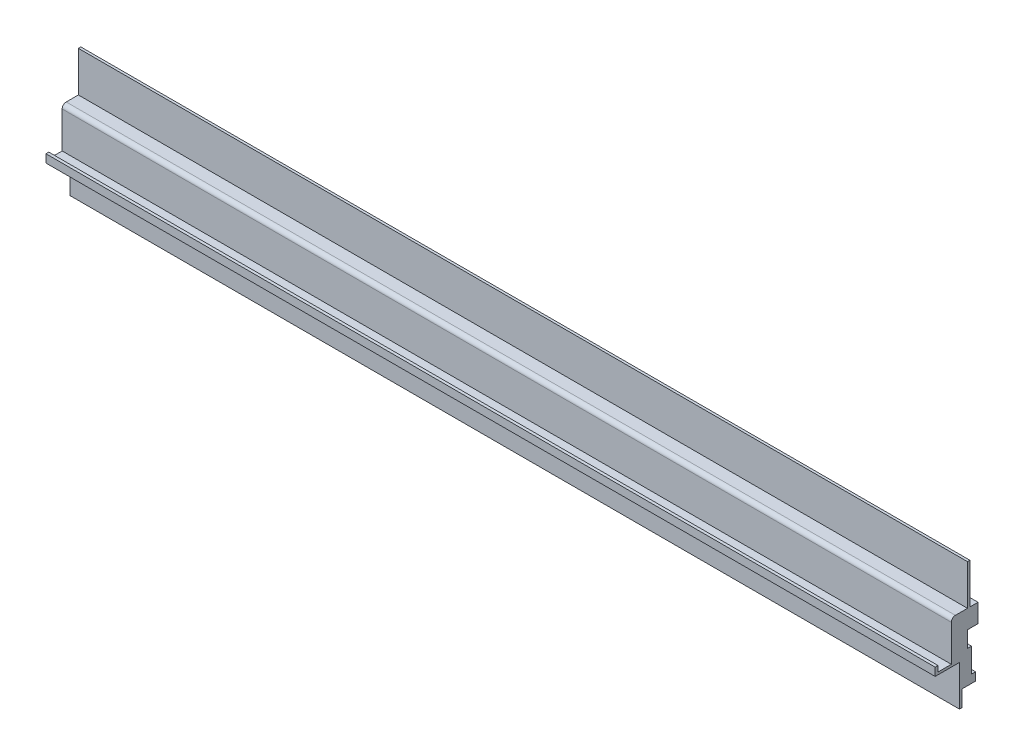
ISO-10303-21;
HEADER;
FILE_DESCRIPTION(('STEP AP214'),'2;1');
FILE_NAME('part.step','',(''),(''),'','','');
FILE_SCHEMA(('AUTOMOTIVE_DESIGN { 1 0 10303 214 1 1 1 1 }'));
ENDSEC;
DATA;
#1=APPLICATION_CONTEXT('core data for automotive mechanical design processes');
#2=APPLICATION_PROTOCOL_DEFINITION('international standard','automotive_design',2000,#1);
#3=PRODUCT_CONTEXT('',#1,'mechanical');
#4=PRODUCT('Part','Part','',(#3));
#5=PRODUCT_RELATED_PRODUCT_CATEGORY('part','',(#4));
#6=PRODUCT_DEFINITION_FORMATION('','',#4);
#7=PRODUCT_DEFINITION_CONTEXT('part definition',#1,'design');
#8=PRODUCT_DEFINITION('design','',#6,#7);
#9=PRODUCT_DEFINITION_SHAPE('','',#8);
#10=(LENGTH_UNIT() NAMED_UNIT(*) SI_UNIT(.MILLI.,.METRE.));
#11=(NAMED_UNIT(*) PLANE_ANGLE_UNIT() SI_UNIT($,.RADIAN.));
#12=(NAMED_UNIT(*) SI_UNIT($,.STERADIAN.) SOLID_ANGLE_UNIT());
#13=UNCERTAINTY_MEASURE_WITH_UNIT(LENGTH_MEASURE(1.E-05),#10,'distance_accuracy_value','');
#14=(GEOMETRIC_REPRESENTATION_CONTEXT(3) GLOBAL_UNCERTAINTY_ASSIGNED_CONTEXT((#13)) GLOBAL_UNIT_ASSIGNED_CONTEXT((#10,
#11,#12)) REPRESENTATION_CONTEXT('',''));
#15=CARTESIAN_POINT('',(0.,0.,0.));
#16=DIRECTION('',(0.,0.,1.));
#17=DIRECTION('',(1.,0.,0.));
#18=AXIS2_PLACEMENT_3D('',#15,#16,#17);
#19=CARTESIAN_POINT('',(550.,34.5171802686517,-10.));
#20=DIRECTION('',(0.,-1.,0.));
#21=DIRECTION('',(0.,0.,-1.));
#22=AXIS2_PLACEMENT_3D('',#19,#20,#21);
#23=PLANE('',#22);
#24=DIRECTION('',(0.,0.,1.));
#25=VECTOR('',#24,1.);
#26=CARTESIAN_POINT('',(-550.,34.5171802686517,-10.));
#27=LINE('',#26,#25);
#28=CARTESIAN_POINT('',(-550.,34.5171802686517,-13.));
#29=VERTEX_POINT('',#28);
#30=CARTESIAN_POINT('',(-550.,34.5171802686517,-10.));
#31=VERTEX_POINT('',#30);
#32=EDGE_CURVE('E213',#29,#31,#27,.T.);
#33=ORIENTED_EDGE('',*,*,#32,.T.);
#34=DIRECTION('',(-1.,0.,0.));
#35=VECTOR('',#34,1.);
#36=CARTESIAN_POINT('',(550.,34.5171802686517,-10.));
#37=LINE('',#36,#35);
#38=CARTESIAN_POINT('',(550.,34.5171802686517,-10.));
#39=VERTEX_POINT('',#38);
#40=EDGE_CURVE('E195',#39,#31,#37,.T.);
#41=ORIENTED_EDGE('',*,*,#40,.F.);
#42=DIRECTION('',(0.,0.,1.));
#43=VECTOR('',#42,1.);
#44=CARTESIAN_POINT('',(550.,34.5171802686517,-10.));
#45=LINE('',#44,#43);
#46=CARTESIAN_POINT('',(550.,34.5171802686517,-13.));
#47=VERTEX_POINT('',#46);
#48=EDGE_CURVE('E201',#47,#39,#45,.T.);
#49=ORIENTED_EDGE('',*,*,#48,.F.);
#50=DIRECTION('',(-1.,0.,0.));
#51=VECTOR('',#50,1.);
#52=CARTESIAN_POINT('',(550.,34.5171802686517,-13.));
#53=LINE('',#52,#51);
#54=EDGE_CURVE('E275',#47,#29,#53,.T.);
#55=ORIENTED_EDGE('',*,*,#54,.T.);
#56=EDGE_LOOP('',(#33,#41,#49,#55));
#57=FACE_BOUND('',#56,.T.);
#58=ADVANCED_FACE('F36',(#57),#23,.F.);
#59=CARTESIAN_POINT('',(550.,34.5171802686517,-10.));
#60=DIRECTION('',(0.,0.,-1.));
#61=DIRECTION('',(0.,1.,0.));
#62=AXIS2_PLACEMENT_3D('',#59,#60,#61);
#63=PLANE('',#62);
#64=DIRECTION('',(0.,-1.,0.));
#65=VECTOR('',#64,1.);
#66=CARTESIAN_POINT('',(-550.,34.5171802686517,-10.));
#67=LINE('',#66,#65);
#68=CARTESIAN_POINT('',(-550.,-15.4828197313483,-10.));
#69=VERTEX_POINT('',#68);
#70=EDGE_CURVE('E316',#31,#69,#67,.T.);
#71=ORIENTED_EDGE('',*,*,#70,.T.);
#72=DIRECTION('',(-1.,0.,0.));
#73=VECTOR('',#72,1.);
#74=CARTESIAN_POINT('',(550.,-15.4828197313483,-10.));
#75=LINE('',#74,#73);
#76=CARTESIAN_POINT('',(550.,-15.4828197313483,-10.));
#77=VERTEX_POINT('',#76);
#78=EDGE_CURVE('E198',#77,#69,#75,.T.);
#79=ORIENTED_EDGE('',*,*,#78,.F.);
#80=DIRECTION('',(0.,-1.,0.));
#81=VECTOR('',#80,1.);
#82=CARTESIAN_POINT('',(550.,34.5171802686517,-10.));
#83=LINE('',#82,#81);
#84=EDGE_CURVE('E191',#39,#77,#83,.T.);
#85=ORIENTED_EDGE('',*,*,#84,.F.);
#86=ORIENTED_EDGE('',*,*,#40,.T.);
#87=EDGE_LOOP('',(#71,#79,#85,#86));
#88=FACE_BOUND('',#87,.T.);
#89=ADVANCED_FACE('F193',(#88),#63,.F.);
#90=CARTESIAN_POINT('',(550.,-15.4828197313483,-10.));
#91=DIRECTION('',(0.,-1.,0.));
#92=DIRECTION('',(0.,0.,-1.));
#93=AXIS2_PLACEMENT_3D('',#90,#91,#92);
#94=PLANE('',#93);
#95=DIRECTION('',(0.,0.,1.));
#96=VECTOR('',#95,1.);
#97=CARTESIAN_POINT('',(-550.,-15.4828197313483,-10.));
#98=LINE('',#97,#96);
#99=CARTESIAN_POINT('',(-550.,-15.4828197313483,4.99999999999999));
#100=VERTEX_POINT('',#99);
#101=EDGE_CURVE('E314',#69,#100,#98,.T.);
#102=ORIENTED_EDGE('',*,*,#101,.T.);
#103=DIRECTION('',(-1.,0.,0.));
#104=VECTOR('',#103,1.);
#105=CARTESIAN_POINT('',(550.,-15.4828197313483,4.99999999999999));
#106=LINE('',#105,#104);
#107=CARTESIAN_POINT('',(550.,-15.4828197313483,4.99999999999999));
#108=VERTEX_POINT('',#107);
#109=EDGE_CURVE('E44',#100,#108,#106,.F.);
#110=ORIENTED_EDGE('',*,*,#109,.T.);
#111=DIRECTION('',(0.,0.,1.));
#112=VECTOR('',#111,1.);
#113=CARTESIAN_POINT('',(550.,-15.4828197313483,-10.));
#114=LINE('',#113,#112);
#115=EDGE_CURVE('E200',#77,#108,#114,.T.);
#116=ORIENTED_EDGE('',*,*,#115,.F.);
#117=ORIENTED_EDGE('',*,*,#78,.T.);
#118=EDGE_LOOP('',(#102,#110,#116,#117));
#119=FACE_BOUND('',#118,.T.);
#120=ADVANCED_FACE('F452',(#119),#94,.F.);
#121=CARTESIAN_POINT('',(550.,-15.4828197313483,9.99999999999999));
#122=DIRECTION('',(0.,0.,-1.));
#123=DIRECTION('',(0.,1.,0.));
#124=AXIS2_PLACEMENT_3D('',#121,#122,#123);
#125=PLANE('',#124);
#126=DIRECTION('',(0.,-1.,0.));
#127=VECTOR('',#126,1.);
#128=CARTESIAN_POINT('',(550.,-15.4828197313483,9.99999999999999));
#129=LINE('',#128,#127);
#130=CARTESIAN_POINT('',(550.,-20.4828197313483,9.99999999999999));
#131=VERTEX_POINT('',#130);
#132=CARTESIAN_POINT('',(550.,-65.4828197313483,9.99999999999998));
#133=VERTEX_POINT('',#132);
#134=EDGE_CURVE('E354',#131,#133,#129,.T.);
#135=ORIENTED_EDGE('',*,*,#134,.F.);
#136=DIRECTION('',(-1.,0.,0.));
#137=VECTOR('',#136,1.);
#138=CARTESIAN_POINT('',(550.,-20.4828197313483,9.99999999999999));
#139=LINE('',#138,#137);
#140=CARTESIAN_POINT('',(-550.,-20.4828197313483,9.99999999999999));
#141=VERTEX_POINT('',#140);
#142=EDGE_CURVE('E214',#131,#141,#139,.T.);
#143=ORIENTED_EDGE('',*,*,#142,.T.);
#144=DIRECTION('',(0.,-1.,0.));
#145=VECTOR('',#144,1.);
#146=CARTESIAN_POINT('',(-550.,-15.4828197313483,9.99999999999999));
#147=LINE('',#146,#145);
#148=CARTESIAN_POINT('',(-550.,-65.4828197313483,9.99999999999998));
#149=VERTEX_POINT('',#148);
#150=EDGE_CURVE('E312',#141,#149,#147,.T.);
#151=ORIENTED_EDGE('',*,*,#150,.T.);
#152=DIRECTION('',(-1.,0.,0.));
#153=VECTOR('',#152,1.);
#154=CARTESIAN_POINT('',(550.,-65.4828197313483,9.99999999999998));
#155=LINE('',#154,#153);
#156=EDGE_CURVE('E218',#133,#149,#155,.T.);
#157=ORIENTED_EDGE('',*,*,#156,.F.);
#158=EDGE_LOOP('',(#135,#143,#151,#157));
#159=FACE_BOUND('',#158,.T.);
#160=ADVANCED_FACE('F361',(#159),#125,.F.);
#161=CARTESIAN_POINT('',(550.,-65.4828197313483,9.99999999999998));
#162=DIRECTION('',(0.,-1.,0.));
#163=DIRECTION('',(0.,0.,-1.));
#164=AXIS2_PLACEMENT_3D('',#161,#162,#163);
#165=PLANE('',#164);
#166=DIRECTION('',(0.,0.,1.));
#167=VECTOR('',#166,1.);
#168=CARTESIAN_POINT('',(-550.,-65.4828197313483,9.99999999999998));
#169=LINE('',#168,#167);
#170=CARTESIAN_POINT('',(-550.,-65.4828197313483,26.4955620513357));
#171=VERTEX_POINT('',#170);
#172=EDGE_CURVE('E310',#149,#171,#169,.T.);
#173=ORIENTED_EDGE('',*,*,#172,.T.);
#174=DIRECTION('',(-1.,0.,0.));
#175=VECTOR('',#174,1.);
#176=CARTESIAN_POINT('',(550.,-65.4828197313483,26.4955620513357));
#177=LINE('',#176,#175);
#178=CARTESIAN_POINT('',(550.,-65.4828197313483,26.4955620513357));
#179=VERTEX_POINT('',#178);
#180=EDGE_CURVE('E224',#179,#171,#177,.T.);
#181=ORIENTED_EDGE('',*,*,#180,.F.);
#182=DIRECTION('',(0.,0.,1.));
#183=VECTOR('',#182,1.);
#184=CARTESIAN_POINT('',(550.,-65.4828197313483,9.99999999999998));
#185=LINE('',#184,#183);
#186=EDGE_CURVE('E352',#133,#179,#185,.T.);
#187=ORIENTED_EDGE('',*,*,#186,.F.);
#188=ORIENTED_EDGE('',*,*,#156,.T.);
#189=EDGE_LOOP('',(#173,#181,#187,#188));
#190=FACE_BOUND('',#189,.T.);
#191=ADVANCED_FACE('F369',(#190),#165,.F.);
#192=CARTESIAN_POINT('',(550.,-65.4828197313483,26.4955620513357));
#193=DIRECTION('',(0.,0.,1.));
#194=DIRECTION('',(1.,0.,0.));
#195=AXIS2_PLACEMENT_3D('',#192,#193,#194);
#196=PLANE('',#195);
#197=DIRECTION('',(0.,1.,0.));
#198=VECTOR('',#197,1.);
#199=CARTESIAN_POINT('',(-550.,-65.4828197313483,26.4955620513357));
#200=LINE('',#199,#198);
#201=CARTESIAN_POINT('',(-550.,-58.4828197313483,26.4955620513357));
#202=VERTEX_POINT('',#201);
#203=EDGE_CURVE('E308',#171,#202,#200,.T.);
#204=ORIENTED_EDGE('',*,*,#203,.T.);
#205=DIRECTION('',(-1.,0.,0.));
#206=VECTOR('',#205,1.);
#207=CARTESIAN_POINT('',(550.,-58.4828197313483,26.4955620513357));
#208=LINE('',#207,#206);
#209=CARTESIAN_POINT('',(550.,-58.4828197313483,26.4955620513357));
#210=VERTEX_POINT('',#209);
#211=EDGE_CURVE('E227',#210,#202,#208,.T.);
#212=ORIENTED_EDGE('',*,*,#211,.F.);
#213=DIRECTION('',(0.,1.,0.));
#214=VECTOR('',#213,1.);
#215=CARTESIAN_POINT('',(550.,-65.4828197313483,26.4955620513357));
#216=LINE('',#215,#214);
#217=EDGE_CURVE('E350',#179,#210,#216,.T.);
#218=ORIENTED_EDGE('',*,*,#217,.F.);
#219=ORIENTED_EDGE('',*,*,#180,.T.);
#220=EDGE_LOOP('',(#204,#212,#218,#219));
#221=FACE_BOUND('',#220,.T.);
#222=ADVANCED_FACE('F373',(#221),#196,.F.);
#223=CARTESIAN_POINT('',(550.,-58.4828197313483,26.4955620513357));
#224=DIRECTION('',(0.,-1.,0.));
#225=DIRECTION('',(0.,0.,-1.));
#226=AXIS2_PLACEMENT_3D('',#223,#224,#225);
#227=PLANE('',#226);
#228=DIRECTION('',(0.,0.,1.));
#229=VECTOR('',#228,1.);
#230=CARTESIAN_POINT('',(-550.,-58.4828197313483,26.4955620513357));
#231=LINE('',#230,#229);
#232=CARTESIAN_POINT('',(-550.,-58.4828197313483,30.));
#233=VERTEX_POINT('',#232);
#234=EDGE_CURVE('E306',#202,#233,#231,.T.);
#235=ORIENTED_EDGE('',*,*,#234,.T.);
#236=DIRECTION('',(-1.,0.,0.));
#237=VECTOR('',#236,1.);
#238=CARTESIAN_POINT('',(550.,-58.4828197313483,30.));
#239=LINE('',#238,#237);
#240=CARTESIAN_POINT('',(550.,-58.4828197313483,30.));
#241=VERTEX_POINT('',#240);
#242=EDGE_CURVE('E230',#241,#233,#239,.T.);
#243=ORIENTED_EDGE('',*,*,#242,.F.);
#244=DIRECTION('',(0.,0.,1.));
#245=VECTOR('',#244,1.);
#246=CARTESIAN_POINT('',(550.,-58.4828197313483,26.4955620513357));
#247=LINE('',#246,#245);
#248=EDGE_CURVE('E348',#210,#241,#247,.T.);
#249=ORIENTED_EDGE('',*,*,#248,.F.);
#250=ORIENTED_EDGE('',*,*,#211,.T.);
#251=EDGE_LOOP('',(#235,#243,#249,#250));
#252=FACE_BOUND('',#251,.T.);
#253=ADVANCED_FACE('F380',(#252),#227,.F.);
#254=CARTESIAN_POINT('',(550.,-58.4828197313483,30.));
#255=DIRECTION('',(0.,0.,-1.));
#256=DIRECTION('',(-1.,0.,0.));
#257=AXIS2_PLACEMENT_3D('',#254,#255,#256);
#258=PLANE('',#257);
#259=DIRECTION('',(0.,-1.,0.));
#260=VECTOR('',#259,1.);
#261=CARTESIAN_POINT('',(-550.,-58.4828197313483,30.));
#262=LINE('',#261,#260);
#263=CARTESIAN_POINT('',(-550.,-68.4828197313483,30.));
#264=VERTEX_POINT('',#263);
#265=EDGE_CURVE('E304',#233,#264,#262,.T.);
#266=ORIENTED_EDGE('',*,*,#265,.T.);
#267=DIRECTION('',(-1.,0.,0.));
#268=VECTOR('',#267,1.);
#269=CARTESIAN_POINT('',(550.,-68.4828197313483,30.));
#270=LINE('',#269,#268);
#271=CARTESIAN_POINT('',(550.,-68.4828197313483,30.));
#272=VERTEX_POINT('',#271);
#273=EDGE_CURVE('E233',#272,#264,#270,.T.);
#274=ORIENTED_EDGE('',*,*,#273,.F.);
#275=DIRECTION('',(0.,-1.,0.));
#276=VECTOR('',#275,1.);
#277=CARTESIAN_POINT('',(550.,-58.4828197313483,30.));
#278=LINE('',#277,#276);
#279=EDGE_CURVE('E346',#241,#272,#278,.T.);
#280=ORIENTED_EDGE('',*,*,#279,.F.);
#281=ORIENTED_EDGE('',*,*,#242,.T.);
#282=EDGE_LOOP('',(#266,#274,#280,#281));
#283=FACE_BOUND('',#282,.T.);
#284=ADVANCED_FACE('F383',(#283),#258,.F.);
#285=CARTESIAN_POINT('',(550.,-68.4828197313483,30.));
#286=DIRECTION('',(0.,1.,0.));
#287=DIRECTION('',(0.,0.,1.));
#288=AXIS2_PLACEMENT_3D('',#285,#286,#287);
#289=PLANE('',#288);
#290=DIRECTION('',(0.,0.,-1.));
#291=VECTOR('',#290,1.);
#292=CARTESIAN_POINT('',(-550.,-68.4828197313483,30.));
#293=LINE('',#292,#291);
#294=CARTESIAN_POINT('',(-550.,-68.4828197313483,0.));
#295=VERTEX_POINT('',#294);
#296=EDGE_CURVE('E302',#264,#295,#293,.T.);
#297=ORIENTED_EDGE('',*,*,#296,.T.);
#298=DIRECTION('',(-1.,0.,0.));
#299=VECTOR('',#298,1.);
#300=CARTESIAN_POINT('',(550.,-68.4828197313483,0.));
#301=LINE('',#300,#299);
#302=CARTESIAN_POINT('',(550.,-68.4828197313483,0.));
#303=VERTEX_POINT('',#302);
#304=EDGE_CURVE('E236',#303,#295,#301,.T.);
#305=ORIENTED_EDGE('',*,*,#304,.F.);
#306=DIRECTION('',(0.,0.,-1.));
#307=VECTOR('',#306,1.);
#308=CARTESIAN_POINT('',(550.,-68.4828197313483,30.));
#309=LINE('',#308,#307);
#310=EDGE_CURVE('E344',#272,#303,#309,.T.);
#311=ORIENTED_EDGE('',*,*,#310,.F.);
#312=ORIENTED_EDGE('',*,*,#273,.T.);
#313=EDGE_LOOP('',(#297,#305,#311,#312));
#314=FACE_BOUND('',#313,.T.);
#315=ADVANCED_FACE('F388',(#314),#289,.F.);
#316=CARTESIAN_POINT('',(550.,-68.4828197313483,0.));
#317=DIRECTION('',(0.,0.,-1.));
#318=DIRECTION('',(0.,1.,0.));
#319=AXIS2_PLACEMENT_3D('',#316,#317,#318);
#320=PLANE('',#319);
#321=DIRECTION('',(0.,-1.,0.));
#322=VECTOR('',#321,1.);
#323=CARTESIAN_POINT('',(-550.,-68.4828197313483,0.));
#324=LINE('',#323,#322);
#325=CARTESIAN_POINT('',(-550.,-118.482819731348,0.));
#326=VERTEX_POINT('',#325);
#327=EDGE_CURVE('E300',#295,#326,#324,.T.);
#328=ORIENTED_EDGE('',*,*,#327,.T.);
#329=DIRECTION('',(-1.,0.,0.));
#330=VECTOR('',#329,1.);
#331=CARTESIAN_POINT('',(550.,-118.482819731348,0.));
#332=LINE('',#331,#330);
#333=CARTESIAN_POINT('',(550.,-118.482819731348,0.));
#334=VERTEX_POINT('',#333);
#335=EDGE_CURVE('E239',#334,#326,#332,.T.);
#336=ORIENTED_EDGE('',*,*,#335,.F.);
#337=DIRECTION('',(0.,-1.,0.));
#338=VECTOR('',#337,1.);
#339=CARTESIAN_POINT('',(550.,-68.4828197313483,0.));
#340=LINE('',#339,#338);
#341=EDGE_CURVE('E342',#303,#334,#340,.T.);
#342=ORIENTED_EDGE('',*,*,#341,.F.);
#343=ORIENTED_EDGE('',*,*,#304,.T.);
#344=EDGE_LOOP('',(#328,#336,#342,#343));
#345=FACE_BOUND('',#344,.T.);
#346=ADVANCED_FACE('F394',(#345),#320,.F.);
#347=CARTESIAN_POINT('',(550.,-118.482819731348,0.));
#348=DIRECTION('',(0.,1.,0.));
#349=DIRECTION('',(0.,0.,1.));
#350=AXIS2_PLACEMENT_3D('',#347,#348,#349);
#351=PLANE('',#350);
#352=DIRECTION('',(0.,0.,-1.));
#353=VECTOR('',#352,1.);
#354=CARTESIAN_POINT('',(-550.,-118.482819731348,0.));
#355=LINE('',#354,#353);
#356=CARTESIAN_POINT('',(-550.,-118.482819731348,-3.00000000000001));
#357=VERTEX_POINT('',#356);
#358=EDGE_CURVE('E298',#326,#357,#355,.T.);
#359=ORIENTED_EDGE('',*,*,#358,.T.);
#360=DIRECTION('',(-1.,0.,0.));
#361=VECTOR('',#360,1.);
#362=CARTESIAN_POINT('',(550.,-118.482819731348,-3.00000000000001));
#363=LINE('',#362,#361);
#364=CARTESIAN_POINT('',(550.,-118.482819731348,-3.00000000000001));
#365=VERTEX_POINT('',#364);
#366=EDGE_CURVE('E242',#365,#357,#363,.T.);
#367=ORIENTED_EDGE('',*,*,#366,.F.);
#368=DIRECTION('',(0.,0.,-1.));
#369=VECTOR('',#368,1.);
#370=CARTESIAN_POINT('',(550.,-118.482819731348,0.));
#371=LINE('',#370,#369);
#372=EDGE_CURVE('E340',#334,#365,#371,.T.);
#373=ORIENTED_EDGE('',*,*,#372,.F.);
#374=ORIENTED_EDGE('',*,*,#335,.T.);
#375=EDGE_LOOP('',(#359,#367,#373,#374));
#376=FACE_BOUND('',#375,.T.);
#377=ADVANCED_FACE('F398',(#376),#351,.F.);
#378=CARTESIAN_POINT('',(550.,-118.482819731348,-3.00000000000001));
#379=DIRECTION('',(0.,0.,1.));
#380=DIRECTION('',(1.,0.,0.));
#381=AXIS2_PLACEMENT_3D('',#378,#379,#380);
#382=PLANE('',#381);
#383=DIRECTION('',(0.,1.,0.));
#384=VECTOR('',#383,1.);
#385=CARTESIAN_POINT('',(-550.,-118.482819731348,-3.00000000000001));
#386=LINE('',#385,#384);
#387=CARTESIAN_POINT('',(-550.,-98.4828197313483,-3.00000000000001));
#388=VERTEX_POINT('',#387);
#389=EDGE_CURVE('E296',#357,#388,#386,.T.);
#390=ORIENTED_EDGE('',*,*,#389,.T.);
#391=DIRECTION('',(-1.,0.,0.));
#392=VECTOR('',#391,1.);
#393=CARTESIAN_POINT('',(550.,-98.4828197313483,-3.00000000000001));
#394=LINE('',#393,#392);
#395=CARTESIAN_POINT('',(550.,-98.4828197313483,-3.00000000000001));
#396=VERTEX_POINT('',#395);
#397=EDGE_CURVE('E245',#396,#388,#394,.T.);
#398=ORIENTED_EDGE('',*,*,#397,.F.);
#399=DIRECTION('',(0.,1.,0.));
#400=VECTOR('',#399,1.);
#401=CARTESIAN_POINT('',(550.,-118.482819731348,-3.00000000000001));
#402=LINE('',#401,#400);
#403=EDGE_CURVE('E338',#365,#396,#402,.T.);
#404=ORIENTED_EDGE('',*,*,#403,.F.);
#405=ORIENTED_EDGE('',*,*,#366,.T.);
#406=EDGE_LOOP('',(#390,#398,#404,#405));
#407=FACE_BOUND('',#406,.T.);
#408=ADVANCED_FACE('F403',(#407),#382,.F.);
#409=CARTESIAN_POINT('',(550.,-98.4828197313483,-20.));
#410=DIRECTION('',(0.,1.,0.));
#411=DIRECTION('',(0.,0.,1.));
#412=AXIS2_PLACEMENT_3D('',#409,#410,#411);
#413=PLANE('',#412);
#414=DIRECTION('',(0.,0.,-1.));
#415=VECTOR('',#414,1.);
#416=CARTESIAN_POINT('',(-550.,-98.4828197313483,-20.));
#417=LINE('',#416,#415);
#418=CARTESIAN_POINT('',(-550.,-98.4828197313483,-20.));
#419=VERTEX_POINT('',#418);
#420=EDGE_CURVE('E294',#388,#419,#417,.T.);
#421=ORIENTED_EDGE('',*,*,#420,.T.);
#422=DIRECTION('',(-1.,0.,0.));
#423=VECTOR('',#422,1.);
#424=CARTESIAN_POINT('',(550.,-98.4828197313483,-20.));
#425=LINE('',#424,#423);
#426=CARTESIAN_POINT('',(550.,-98.4828197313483,-20.));
#427=VERTEX_POINT('',#426);
#428=EDGE_CURVE('E248',#427,#419,#425,.T.);
#429=ORIENTED_EDGE('',*,*,#428,.F.);
#430=DIRECTION('',(0.,0.,-1.));
#431=VECTOR('',#430,1.);
#432=CARTESIAN_POINT('',(550.,-98.4828197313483,-20.));
#433=LINE('',#432,#431);
#434=EDGE_CURVE('E336',#396,#427,#433,.T.);
#435=ORIENTED_EDGE('',*,*,#434,.F.);
#436=ORIENTED_EDGE('',*,*,#397,.T.);
#437=EDGE_LOOP('',(#421,#429,#435,#436));
#438=FACE_BOUND('',#437,.T.);
#439=ADVANCED_FACE('F409',(#438),#413,.F.);
#440=CARTESIAN_POINT('',(550.,-88.4828197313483,-20.));
#441=DIRECTION('',(0.,0.,1.));
#442=DIRECTION('',(1.,0.,0.));
#443=AXIS2_PLACEMENT_3D('',#440,#441,#442);
#444=PLANE('',#443);
#445=DIRECTION('',(0.,1.,0.));
#446=VECTOR('',#445,1.);
#447=CARTESIAN_POINT('',(-550.,-88.4828197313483,-20.));
#448=LINE('',#447,#446);
#449=CARTESIAN_POINT('',(-550.,-88.4828197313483,-20.));
#450=VERTEX_POINT('',#449);
#451=EDGE_CURVE('E292',#419,#450,#448,.T.);
#452=ORIENTED_EDGE('',*,*,#451,.T.);
#453=DIRECTION('',(-1.,0.,0.));
#454=VECTOR('',#453,1.);
#455=CARTESIAN_POINT('',(550.,-88.4828197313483,-20.));
#456=LINE('',#455,#454);
#457=CARTESIAN_POINT('',(550.,-88.4828197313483,-20.));
#458=VERTEX_POINT('',#457);
#459=EDGE_CURVE('E251',#458,#450,#456,.T.);
#460=ORIENTED_EDGE('',*,*,#459,.F.);
#461=DIRECTION('',(0.,1.,0.));
#462=VECTOR('',#461,1.);
#463=CARTESIAN_POINT('',(550.,-88.4828197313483,-20.));
#464=LINE('',#463,#462);
#465=EDGE_CURVE('E334',#427,#458,#464,.T.);
#466=ORIENTED_EDGE('',*,*,#465,.F.);
#467=ORIENTED_EDGE('',*,*,#428,.T.);
#468=EDGE_LOOP('',(#452,#460,#466,#467));
#469=FACE_BOUND('',#468,.T.);
#470=ADVANCED_FACE('F413',(#469),#444,.F.);
#471=CARTESIAN_POINT('',(550.,-88.4828197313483,-15.));
#472=DIRECTION('',(0.,-1.,0.));
#473=DIRECTION('',(0.,0.,-1.));
#474=AXIS2_PLACEMENT_3D('',#471,#472,#473);
#475=PLANE('',#474);
#476=DIRECTION('',(0.,0.,1.));
#477=VECTOR('',#476,1.);
#478=CARTESIAN_POINT('',(-550.,-88.4828197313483,-15.));
#479=LINE('',#478,#477);
#480=CARTESIAN_POINT('',(-550.,-88.4828197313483,-15.));
#481=VERTEX_POINT('',#480);
#482=EDGE_CURVE('E290',#450,#481,#479,.T.);
#483=ORIENTED_EDGE('',*,*,#482,.T.);
#484=DIRECTION('',(-1.,0.,0.));
#485=VECTOR('',#484,1.);
#486=CARTESIAN_POINT('',(550.,-88.4828197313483,-15.));
#487=LINE('',#486,#485);
#488=CARTESIAN_POINT('',(550.,-88.4828197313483,-15.));
#489=VERTEX_POINT('',#488);
#490=EDGE_CURVE('E254',#489,#481,#487,.T.);
#491=ORIENTED_EDGE('',*,*,#490,.F.);
#492=DIRECTION('',(0.,0.,1.));
#493=VECTOR('',#492,1.);
#494=CARTESIAN_POINT('',(550.,-88.4828197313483,-15.));
#495=LINE('',#494,#493);
#496=EDGE_CURVE('E332',#458,#489,#495,.T.);
#497=ORIENTED_EDGE('',*,*,#496,.F.);
#498=ORIENTED_EDGE('',*,*,#459,.T.);
#499=EDGE_LOOP('',(#483,#491,#497,#498));
#500=FACE_BOUND('',#499,.T.);
#501=ADVANCED_FACE('F418',(#500),#475,.F.);
#502=CARTESIAN_POINT('',(550.,-58.4828197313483,-15.));
#503=DIRECTION('',(0.,0.,1.));
#504=DIRECTION('',(0.,-1.,0.));
#505=AXIS2_PLACEMENT_3D('',#502,#503,#504);
#506=PLANE('',#505);
#507=DIRECTION('',(0.,1.,0.));
#508=VECTOR('',#507,1.);
#509=CARTESIAN_POINT('',(-550.,-58.4828197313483,-15.));
#510=LINE('',#509,#508);
#511=CARTESIAN_POINT('',(-550.,-58.4828197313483,-15.));
#512=VERTEX_POINT('',#511);
#513=EDGE_CURVE('E288',#481,#512,#510,.T.);
#514=ORIENTED_EDGE('',*,*,#513,.T.);
#515=DIRECTION('',(-1.,0.,0.));
#516=VECTOR('',#515,1.);
#517=CARTESIAN_POINT('',(550.,-58.4828197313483,-15.));
#518=LINE('',#517,#516);
#519=CARTESIAN_POINT('',(550.,-58.4828197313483,-15.));
#520=VERTEX_POINT('',#519);
#521=EDGE_CURVE('E257',#520,#512,#518,.T.);
#522=ORIENTED_EDGE('',*,*,#521,.F.);
#523=DIRECTION('',(0.,1.,0.));
#524=VECTOR('',#523,1.);
#525=CARTESIAN_POINT('',(550.,-58.4828197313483,-15.));
#526=LINE('',#525,#524);
#527=EDGE_CURVE('E330',#489,#520,#526,.T.);
#528=ORIENTED_EDGE('',*,*,#527,.F.);
#529=ORIENTED_EDGE('',*,*,#490,.T.);
#530=EDGE_LOOP('',(#514,#522,#528,#529));
#531=FACE_BOUND('',#530,.T.);
#532=ADVANCED_FACE('F424',(#531),#506,.F.);
#533=CARTESIAN_POINT('',(550.,-58.4828197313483,-10.));
#534=DIRECTION('',(0.,-1.,0.));
#535=DIRECTION('',(0.,0.,-1.));
#536=AXIS2_PLACEMENT_3D('',#533,#534,#535);
#537=PLANE('',#536);
#538=DIRECTION('',(0.,0.,1.));
#539=VECTOR('',#538,1.);
#540=CARTESIAN_POINT('',(-550.,-58.4828197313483,-10.));
#541=LINE('',#540,#539);
#542=CARTESIAN_POINT('',(-550.,-58.4828197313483,-10.));
#543=VERTEX_POINT('',#542);
#544=EDGE_CURVE('E286',#512,#543,#541,.T.);
#545=ORIENTED_EDGE('',*,*,#544,.T.);
#546=DIRECTION('',(-1.,0.,0.));
#547=VECTOR('',#546,1.);
#548=CARTESIAN_POINT('',(550.,-58.4828197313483,-10.));
#549=LINE('',#548,#547);
#550=CARTESIAN_POINT('',(550.,-58.4828197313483,-10.));
#551=VERTEX_POINT('',#550);
#552=EDGE_CURVE('E260',#551,#543,#549,.T.);
#553=ORIENTED_EDGE('',*,*,#552,.F.);
#554=DIRECTION('',(0.,0.,1.));
#555=VECTOR('',#554,1.);
#556=CARTESIAN_POINT('',(550.,-58.4828197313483,-10.));
#557=LINE('',#556,#555);
#558=EDGE_CURVE('E328',#520,#551,#557,.T.);
#559=ORIENTED_EDGE('',*,*,#558,.F.);
#560=ORIENTED_EDGE('',*,*,#521,.T.);
#561=EDGE_LOOP('',(#545,#553,#559,#560));
#562=FACE_BOUND('',#561,.T.);
#563=ADVANCED_FACE('F428',(#562),#537,.F.);
#564=CARTESIAN_POINT('',(550.,-38.4828197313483,-10.));
#565=DIRECTION('',(0.,0.,1.));
#566=DIRECTION('',(0.,-1.,0.));
#567=AXIS2_PLACEMENT_3D('',#564,#565,#566);
#568=PLANE('',#567);
#569=DIRECTION('',(0.,1.,0.));
#570=VECTOR('',#569,1.);
#571=CARTESIAN_POINT('',(-550.,-38.4828197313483,-10.));
#572=LINE('',#571,#570);
#573=CARTESIAN_POINT('',(-550.,-38.4828197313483,-10.));
#574=VERTEX_POINT('',#573);
#575=EDGE_CURVE('E284',#543,#574,#572,.T.);
#576=ORIENTED_EDGE('',*,*,#575,.T.);
#577=DIRECTION('',(-1.,0.,0.));
#578=VECTOR('',#577,1.);
#579=CARTESIAN_POINT('',(550.,-38.4828197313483,-10.));
#580=LINE('',#579,#578);
#581=CARTESIAN_POINT('',(550.,-38.4828197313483,-10.));
#582=VERTEX_POINT('',#581);
#583=EDGE_CURVE('E263',#582,#574,#580,.T.);
#584=ORIENTED_EDGE('',*,*,#583,.F.);
#585=DIRECTION('',(0.,1.,0.));
#586=VECTOR('',#585,1.);
#587=CARTESIAN_POINT('',(550.,-38.4828197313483,-10.));
#588=LINE('',#587,#586);
#589=EDGE_CURVE('E326',#551,#582,#588,.T.);
#590=ORIENTED_EDGE('',*,*,#589,.F.);
#591=ORIENTED_EDGE('',*,*,#552,.T.);
#592=EDGE_LOOP('',(#576,#584,#590,#591));
#593=FACE_BOUND('',#592,.T.);
#594=ADVANCED_FACE('F433',(#593),#568,.F.);
#595=CARTESIAN_POINT('',(550.,-38.4828197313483,-10.));
#596=DIRECTION('',(0.,1.,0.));
#597=DIRECTION('',(0.,0.,1.));
#598=AXIS2_PLACEMENT_3D('',#595,#596,#597);
#599=PLANE('',#598);
#600=DIRECTION('',(0.,0.,-1.));
#601=VECTOR('',#600,1.);
#602=CARTESIAN_POINT('',(-550.,-38.4828197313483,-10.));
#603=LINE('',#602,#601);
#604=CARTESIAN_POINT('',(-550.,-38.4828197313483,-23.));
#605=VERTEX_POINT('',#604);
#606=EDGE_CURVE('E282',#574,#605,#603,.T.);
#607=ORIENTED_EDGE('',*,*,#606,.T.);
#608=DIRECTION('',(-1.,0.,0.));
#609=VECTOR('',#608,1.);
#610=CARTESIAN_POINT('',(550.,-38.4828197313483,-23.));
#611=LINE('',#610,#609);
#612=CARTESIAN_POINT('',(550.,-38.4828197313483,-23.));
#613=VERTEX_POINT('',#612);
#614=EDGE_CURVE('E266',#613,#605,#611,.T.);
#615=ORIENTED_EDGE('',*,*,#614,.F.);
#616=DIRECTION('',(0.,0.,-1.));
#617=VECTOR('',#616,1.);
#618=CARTESIAN_POINT('',(550.,-38.4828197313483,-10.));
#619=LINE('',#618,#617);
#620=EDGE_CURVE('E324',#582,#613,#619,.T.);
#621=ORIENTED_EDGE('',*,*,#620,.F.);
#622=ORIENTED_EDGE('',*,*,#583,.T.);
#623=EDGE_LOOP('',(#607,#615,#621,#622));
#624=FACE_BOUND('',#623,.T.);
#625=ADVANCED_FACE('F439',(#624),#599,.F.);
#626=CARTESIAN_POINT('',(550.,-15.4828197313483,-23.));
#627=DIRECTION('',(0.,0.,1.));
#628=DIRECTION('',(0.,-1.,0.));
#629=AXIS2_PLACEMENT_3D('',#626,#627,#628);
#630=PLANE('',#629);
#631=DIRECTION('',(0.,1.,0.));
#632=VECTOR('',#631,1.);
#633=CARTESIAN_POINT('',(-550.,-15.4828197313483,-23.));
#634=LINE('',#633,#632);
#635=CARTESIAN_POINT('',(-550.,-15.4828197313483,-23.));
#636=VERTEX_POINT('',#635);
#637=EDGE_CURVE('E280',#605,#636,#634,.T.);
#638=ORIENTED_EDGE('',*,*,#637,.T.);
#639=DIRECTION('',(-1.,0.,0.));
#640=VECTOR('',#639,1.);
#641=CARTESIAN_POINT('',(550.,-15.4828197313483,-23.));
#642=LINE('',#641,#640);
#643=CARTESIAN_POINT('',(550.,-15.4828197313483,-23.));
#644=VERTEX_POINT('',#643);
#645=EDGE_CURVE('E269',#644,#636,#642,.T.);
#646=ORIENTED_EDGE('',*,*,#645,.F.);
#647=DIRECTION('',(0.,1.,0.));
#648=VECTOR('',#647,1.);
#649=CARTESIAN_POINT('',(550.,-15.4828197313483,-23.));
#650=LINE('',#649,#648);
#651=EDGE_CURVE('E322',#613,#644,#650,.T.);
#652=ORIENTED_EDGE('',*,*,#651,.F.);
#653=ORIENTED_EDGE('',*,*,#614,.T.);
#654=EDGE_LOOP('',(#638,#646,#652,#653));
#655=FACE_BOUND('',#654,.T.);
#656=ADVANCED_FACE('F443',(#655),#630,.F.);
#657=CARTESIAN_POINT('',(550.,-15.4828197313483,-13.));
#658=DIRECTION('',(0.,-1.,0.));
#659=DIRECTION('',(0.,0.,-1.));
#660=AXIS2_PLACEMENT_3D('',#657,#658,#659);
#661=PLANE('',#660);
#662=DIRECTION('',(0.,0.,1.));
#663=VECTOR('',#662,1.);
#664=CARTESIAN_POINT('',(-550.,-15.4828197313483,-13.));
#665=LINE('',#664,#663);
#666=CARTESIAN_POINT('',(-550.,-15.4828197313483,-13.));
#667=VERTEX_POINT('',#666);
#668=EDGE_CURVE('E278',#636,#667,#665,.T.);
#669=ORIENTED_EDGE('',*,*,#668,.T.);
#670=DIRECTION('',(-1.,0.,0.));
#671=VECTOR('',#670,1.);
#672=CARTESIAN_POINT('',(550.,-15.4828197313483,-13.));
#673=LINE('',#672,#671);
#674=CARTESIAN_POINT('',(550.,-15.4828197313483,-13.));
#675=VERTEX_POINT('',#674);
#676=EDGE_CURVE('E272',#675,#667,#673,.T.);
#677=ORIENTED_EDGE('',*,*,#676,.F.);
#678=DIRECTION('',(0.,0.,1.));
#679=VECTOR('',#678,1.);
#680=CARTESIAN_POINT('',(550.,-15.4828197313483,-13.));
#681=LINE('',#680,#679);
#682=EDGE_CURVE('E320',#644,#675,#681,.T.);
#683=ORIENTED_EDGE('',*,*,#682,.F.);
#684=ORIENTED_EDGE('',*,*,#645,.T.);
#685=EDGE_LOOP('',(#669,#677,#683,#684));
#686=FACE_BOUND('',#685,.T.);
#687=ADVANCED_FACE('F448',(#686),#661,.F.);
#688=CARTESIAN_POINT('',(550.,34.5171802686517,-13.));
#689=DIRECTION('',(0.,0.,1.));
#690=DIRECTION('',(0.,-1.,0.));
#691=AXIS2_PLACEMENT_3D('',#688,#689,#690);
#692=PLANE('',#691);
#693=DIRECTION('',(0.,1.,0.));
#694=VECTOR('',#693,1.);
#695=CARTESIAN_POINT('',(-550.,34.5171802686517,-13.));
#696=LINE('',#695,#694);
#697=EDGE_CURVE('E210',#667,#29,#696,.T.);
#698=ORIENTED_EDGE('',*,*,#697,.T.);
#699=ORIENTED_EDGE('',*,*,#54,.F.);
#700=DIRECTION('',(0.,1.,0.));
#701=VECTOR('',#700,1.);
#702=CARTESIAN_POINT('',(550.,34.5171802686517,-13.));
#703=LINE('',#702,#701);
#704=EDGE_CURVE('E206',#675,#47,#703,.T.);
#705=ORIENTED_EDGE('',*,*,#704,.F.);
#706=ORIENTED_EDGE('',*,*,#676,.T.);
#707=EDGE_LOOP('',(#698,#699,#705,#706));
#708=FACE_BOUND('',#707,.T.);
#709=ADVANCED_FACE('F451',(#708),#692,.F.);
#710=CARTESIAN_POINT('',(550.,0.,0.));
#711=DIRECTION('',(-1.,0.,0.));
#712=DIRECTION('',(0.,0.,1.));
#713=AXIS2_PLACEMENT_3D('',#710,#711,#712);
#714=PLANE('',#713);
#715=ORIENTED_EDGE('',*,*,#115,.T.);
#716=CARTESIAN_POINT('',(550.,-20.4828197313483,4.99999999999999));
#717=DIRECTION('',(-1.,0.,0.));
#718=DIRECTION('',(0.,0.,1.));
#719=AXIS2_PLACEMENT_3D('',#716,#717,#718);
#720=CIRCLE('',#719,5.);
#721=EDGE_CURVE('E11',#108,#131,#720,.F.);
#722=ORIENTED_EDGE('',*,*,#721,.T.);
#723=ORIENTED_EDGE('',*,*,#134,.T.);
#724=ORIENTED_EDGE('',*,*,#186,.T.);
#725=ORIENTED_EDGE('',*,*,#217,.T.);
#726=ORIENTED_EDGE('',*,*,#248,.T.);
#727=ORIENTED_EDGE('',*,*,#279,.T.);
#728=ORIENTED_EDGE('',*,*,#310,.T.);
#729=ORIENTED_EDGE('',*,*,#341,.T.);
#730=ORIENTED_EDGE('',*,*,#372,.T.);
#731=ORIENTED_EDGE('',*,*,#403,.T.);
#732=ORIENTED_EDGE('',*,*,#434,.T.);
#733=ORIENTED_EDGE('',*,*,#465,.T.);
#734=ORIENTED_EDGE('',*,*,#496,.T.);
#735=ORIENTED_EDGE('',*,*,#527,.T.);
#736=ORIENTED_EDGE('',*,*,#558,.T.);
#737=ORIENTED_EDGE('',*,*,#589,.T.);
#738=ORIENTED_EDGE('',*,*,#620,.T.);
#739=ORIENTED_EDGE('',*,*,#651,.T.);
#740=ORIENTED_EDGE('',*,*,#682,.T.);
#741=ORIENTED_EDGE('',*,*,#704,.T.);
#742=ORIENTED_EDGE('',*,*,#48,.T.);
#743=ORIENTED_EDGE('',*,*,#84,.T.);
#744=EDGE_LOOP('',(#715,#722,#723,#724,#725,#726,#727,#728,#729,#730,#731,#732,#733,#734,#735,
#736,#737,#738,#739,#740,#741,#742,#743));
#745=FACE_BOUND('',#744,.T.);
#746=ADVANCED_FACE('F204',(#745),#714,.F.);
#747=CARTESIAN_POINT('',(-550.,0.,0.));
#748=DIRECTION('',(-1.,0.,0.));
#749=DIRECTION('',(0.,0.,1.));
#750=AXIS2_PLACEMENT_3D('',#747,#748,#749);
#751=PLANE('',#750);
#752=ORIENTED_EDGE('',*,*,#150,.F.);
#753=CARTESIAN_POINT('',(-550.,-20.4828197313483,4.99999999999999));
#754=DIRECTION('',(-1.,0.,0.));
#755=DIRECTION('',(0.,0.,1.));
#756=AXIS2_PLACEMENT_3D('',#753,#754,#755);
#757=CIRCLE('',#756,5.);
#758=EDGE_CURVE('E58',#141,#100,#757,.T.);
#759=ORIENTED_EDGE('',*,*,#758,.T.);
#760=ORIENTED_EDGE('',*,*,#101,.F.);
#761=ORIENTED_EDGE('',*,*,#70,.F.);
#762=ORIENTED_EDGE('',*,*,#32,.F.);
#763=ORIENTED_EDGE('',*,*,#697,.F.);
#764=ORIENTED_EDGE('',*,*,#668,.F.);
#765=ORIENTED_EDGE('',*,*,#637,.F.);
#766=ORIENTED_EDGE('',*,*,#606,.F.);
#767=ORIENTED_EDGE('',*,*,#575,.F.);
#768=ORIENTED_EDGE('',*,*,#544,.F.);
#769=ORIENTED_EDGE('',*,*,#513,.F.);
#770=ORIENTED_EDGE('',*,*,#482,.F.);
#771=ORIENTED_EDGE('',*,*,#451,.F.);
#772=ORIENTED_EDGE('',*,*,#420,.F.);
#773=ORIENTED_EDGE('',*,*,#389,.F.);
#774=ORIENTED_EDGE('',*,*,#358,.F.);
#775=ORIENTED_EDGE('',*,*,#327,.F.);
#776=ORIENTED_EDGE('',*,*,#296,.F.);
#777=ORIENTED_EDGE('',*,*,#265,.F.);
#778=ORIENTED_EDGE('',*,*,#234,.F.);
#779=ORIENTED_EDGE('',*,*,#203,.F.);
#780=ORIENTED_EDGE('',*,*,#172,.F.);
#781=EDGE_LOOP('',(#752,#759,#760,#761,#762,#763,#764,#765,#766,#767,#768,#769,#770,#771,#772,
#773,#774,#775,#776,#777,#778,#779,#780));
#782=FACE_BOUND('',#781,.T.);
#783=ADVANCED_FACE('F364',(#782),#751,.T.);
#784=CARTESIAN_POINT('',(550.,-20.4828197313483,4.99999999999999));
#785=DIRECTION('',(-1.,0.,0.));
#786=DIRECTION('',(0.,0.,1.));
#787=AXIS2_PLACEMENT_3D('',#784,#785,#786);
#788=CYLINDRICAL_SURFACE('',#787,5.);
#789=ORIENTED_EDGE('',*,*,#721,.F.);
#790=ORIENTED_EDGE('',*,*,#109,.F.);
#791=ORIENTED_EDGE('',*,*,#758,.F.);
#792=ORIENTED_EDGE('',*,*,#142,.F.);
#793=EDGE_LOOP('',(#789,#790,#791,#792));
#794=FACE_BOUND('',#793,.T.);
#795=ADVANCED_FACE('F38',(#794),#788,.T.);
#796=CLOSED_SHELL('',(#58,#89,#120,#160,#191,#222,#253,#284,#315,#346,#377,#408,#439,#470,#501,
#532,#563,#594,#625,#656,#687,#709,#746,#783,#795));
#797=MANIFOLD_SOLID_BREP('B2',#796);
#798=ADVANCED_BREP_SHAPE_REPRESENTATION('',(#18,#797),#14);
#799=SHAPE_DEFINITION_REPRESENTATION(#9,#798);
ENDSEC;
END-ISO-10303-21;
